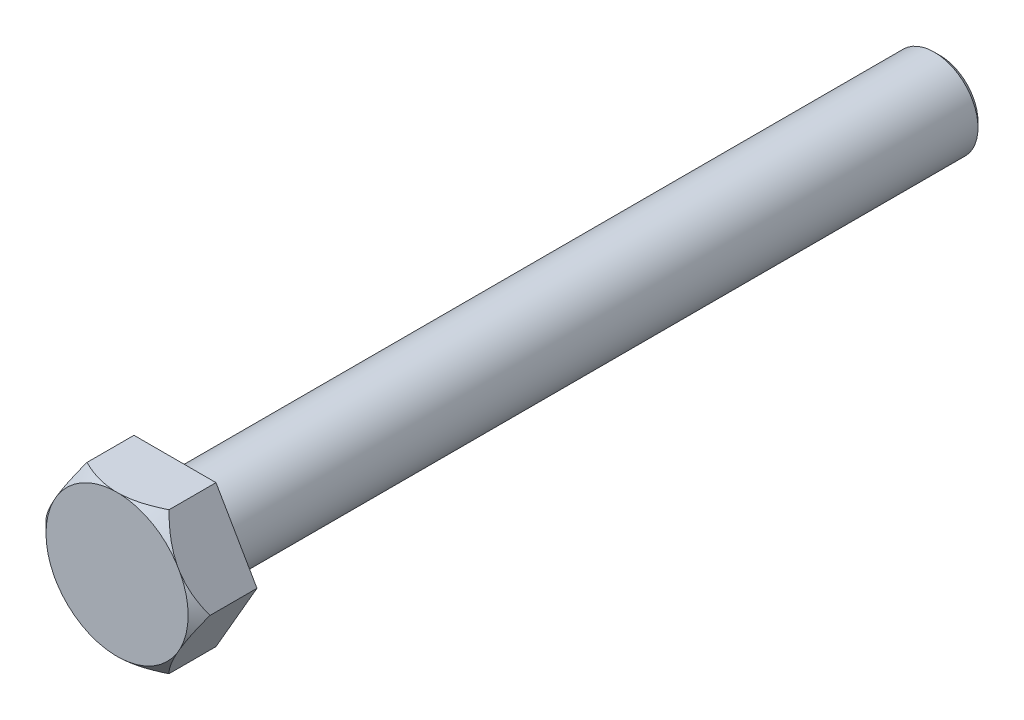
ISO-10303-21;
HEADER;
FILE_DESCRIPTION(('STEP AP214'),'2;1');
FILE_NAME('part.step','',(''),(''),'','','');
FILE_SCHEMA(('AUTOMOTIVE_DESIGN { 1 0 10303 214 1 1 1 1 }'));
ENDSEC;
DATA;
#1=APPLICATION_CONTEXT('core data for automotive mechanical design processes');
#2=APPLICATION_PROTOCOL_DEFINITION('international standard','automotive_design',2000,#1);
#3=PRODUCT_CONTEXT('',#1,'mechanical');
#4=PRODUCT('Part','Part','',(#3));
#5=PRODUCT_RELATED_PRODUCT_CATEGORY('part','',(#4));
#6=PRODUCT_DEFINITION_FORMATION('','',#4);
#7=PRODUCT_DEFINITION_CONTEXT('part definition',#1,'design');
#8=PRODUCT_DEFINITION('design','',#6,#7);
#9=PRODUCT_DEFINITION_SHAPE('','',#8);
#10=(LENGTH_UNIT() NAMED_UNIT(*) SI_UNIT(.MILLI.,.METRE.));
#11=(NAMED_UNIT(*) PLANE_ANGLE_UNIT() SI_UNIT($,.RADIAN.));
#12=(NAMED_UNIT(*) SI_UNIT($,.STERADIAN.) SOLID_ANGLE_UNIT());
#13=UNCERTAINTY_MEASURE_WITH_UNIT(LENGTH_MEASURE(1.E-05),#10,'distance_accuracy_value','');
#14=(GEOMETRIC_REPRESENTATION_CONTEXT(3) GLOBAL_UNCERTAINTY_ASSIGNED_CONTEXT((#13)) GLOBAL_UNIT_ASSIGNED_CONTEXT((#10,
#11,#12)) REPRESENTATION_CONTEXT('',''));
#15=CARTESIAN_POINT('',(0.,0.,0.));
#16=DIRECTION('',(0.,0.,1.));
#17=DIRECTION('',(1.,0.,0.));
#18=AXIS2_PLACEMENT_3D('',#15,#16,#17);
#19=CARTESIAN_POINT('',(0.,-4.,0.));
#20=DIRECTION('',(0.,0.,1.));
#21=DIRECTION('',(1.,0.,0.));
#22=AXIS2_PLACEMENT_3D('',#19,#20,#21);
#23=PLANE('',#22);
#24=CARTESIAN_POINT('',(0.,0.,0.));
#25=DIRECTION('',(0.,0.,1.));
#26=DIRECTION('',(1.,0.,0.));
#27=AXIS2_PLACEMENT_3D('',#24,#25,#26);
#28=CIRCLE('',#27,4.);
#29=CARTESIAN_POINT('',(4.,0.,0.));
#30=VERTEX_POINT('',#29);
#31=EDGE_CURVE('E11',#30,#30,#28,.T.);
#32=ORIENTED_EDGE('',*,*,#31,.T.);
#33=EDGE_LOOP('',(#32));
#34=FACE_BOUND('',#33,.T.);
#35=ADVANCED_FACE('F38',(#34),#23,.T.);
#36=CARTESIAN_POINT('',(0.,0.,0.));
#37=DIRECTION('',(0.,0.,1.));
#38=DIRECTION('',(1.,0.,0.));
#39=AXIS2_PLACEMENT_3D('',#36,#37,#38);
#40=CYLINDRICAL_SURFACE('',#39,4.);
#41=CARTESIAN_POINT('',(0.,0.,-69.5));
#42=DIRECTION('',(0.,0.,1.));
#43=DIRECTION('',(1.,0.,0.));
#44=AXIS2_PLACEMENT_3D('',#41,#42,#43);
#45=CIRCLE('',#44,4.);
#46=CARTESIAN_POINT('',(4.,0.,-69.5));
#47=VERTEX_POINT('',#46);
#48=EDGE_CURVE('E44',#47,#47,#45,.T.);
#49=ORIENTED_EDGE('',*,*,#48,.T.);
#50=EDGE_LOOP('',(#49));
#51=FACE_BOUND('',#50,.T.);
#52=ORIENTED_EDGE('',*,*,#31,.F.);
#53=EDGE_LOOP('',(#52));
#54=FACE_BOUND('',#53,.T.);
#55=ADVANCED_FACE('F64',(#51,#54),#40,.T.);
#56=CARTESIAN_POINT('',(0.,0.,-69.5));
#57=DIRECTION('',(0.,0.,1.));
#58=DIRECTION('',(1.,0.,0.));
#59=AXIS2_PLACEMENT_3D('',#56,#57,#58);
#60=CONICAL_SURFACE('',#59,4.,0.785398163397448);
#61=CARTESIAN_POINT('',(0.,0.,-70.));
#62=DIRECTION('',(0.,0.,1.));
#63=DIRECTION('',(1.,0.,0.));
#64=AXIS2_PLACEMENT_3D('',#61,#62,#63);
#65=CIRCLE('',#64,3.5);
#66=CARTESIAN_POINT('',(3.5,0.,-70.));
#67=VERTEX_POINT('',#66);
#68=EDGE_CURVE('E48',#67,#67,#65,.T.);
#69=ORIENTED_EDGE('',*,*,#68,.T.);
#70=EDGE_LOOP('',(#69));
#71=FACE_BOUND('',#70,.T.);
#72=ORIENTED_EDGE('',*,*,#48,.F.);
#73=EDGE_LOOP('',(#72));
#74=FACE_BOUND('',#73,.T.);
#75=ADVANCED_FACE('F55',(#71,#74),#60,.T.);
#76=CARTESIAN_POINT('',(0.,-3.5,-70.));
#77=DIRECTION('',(0.,0.,-1.));
#78=DIRECTION('',(-1.,0.,0.));
#79=AXIS2_PLACEMENT_3D('',#76,#77,#78);
#80=PLANE('',#79);
#81=ORIENTED_EDGE('',*,*,#68,.F.);
#82=EDGE_LOOP('',(#81));
#83=FACE_BOUND('',#82,.T.);
#84=ADVANCED_FACE('F58',(#83),#80,.T.);
#85=CLOSED_SHELL('',(#35,#55,#75,#84));
#86=MANIFOLD_SOLID_BREP('B2',#85);
#87=CARTESIAN_POINT('',(3.75277674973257,-6.5,5.3));
#88=DIRECTION('',(-0.866025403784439,0.5,0.));
#89=DIRECTION('',(-0.5,-0.866025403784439,0.));
#90=AXIS2_PLACEMENT_3D('',#87,#88,#89);
#91=PLANE('',#90);
#92=DIRECTION('',(0.,0.,-1.));
#93=VECTOR('',#92,1.);
#94=CARTESIAN_POINT('',(7.50555349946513,0.,5.3));
#95=LINE('',#94,#93);
#96=CARTESIAN_POINT('',(7.50555349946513,0.,4.3));
#97=VERTEX_POINT('',#96);
#98=CARTESIAN_POINT('',(7.50555349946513,0.,0.));
#99=VERTEX_POINT('',#98);
#100=EDGE_CURVE('E240',#97,#99,#95,.T.);
#101=ORIENTED_EDGE('',*,*,#100,.F.);
#102=CARTESIAN_POINT('',(10.1286443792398,4.54332667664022,0.704596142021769));
#103=CARTESIAN_POINT('',(10.039761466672,4.38937695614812,0.848684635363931));
#104=CARTESIAN_POINT('',(9.95052655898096,4.23481756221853,0.991912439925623));
#105=CARTESIAN_POINT('',(9.77123095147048,3.92426846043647,1.27631743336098));
#106=CARTESIAN_POINT('',(9.68117017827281,3.76827862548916,1.41749443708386));
#107=CARTESIAN_POINT('',(9.49990390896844,3.45431623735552,1.69777201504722));
#108=CARTESIAN_POINT('',(9.40869621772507,3.29633988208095,1.83686692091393));
#109=CARTESIAN_POINT('',(9.2252068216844,2.97852692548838,2.11218789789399));
#110=CARTESIAN_POINT('',(9.13292514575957,2.81869037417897,2.24841404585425));
#111=CARTESIAN_POINT('',(8.94456358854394,2.49243858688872,2.52115169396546));
#112=CARTESIAN_POINT('',(8.84844908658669,2.32596338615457,2.65756778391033));
#113=CARTESIAN_POINT('',(8.65470525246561,1.99038922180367,2.92602381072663));
#114=CARTESIAN_POINT('',(8.5570759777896,1.82129035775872,3.0580639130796));
#115=CARTESIAN_POINT('',(8.36013893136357,1.48018538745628,3.31668899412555));
#116=CARTESIAN_POINT('',(8.26083264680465,1.30818185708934,3.44327848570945));
#117=CARTESIAN_POINT('',(8.0601982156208,0.960672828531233,3.68985078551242));
#118=CARTESIAN_POINT('',(7.95887032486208,0.78516777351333,3.80983442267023));
#119=CARTESIAN_POINT('',(7.75111491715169,0.425324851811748,4.04472132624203));
#120=CARTESIAN_POINT('',(7.64462356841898,0.24087642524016,4.15940026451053));
#121=CARTESIAN_POINT('',(7.42883796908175,-0.132875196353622,4.37785828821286));
#122=CARTESIAN_POINT('',(7.31954332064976,-0.3221790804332,4.48163581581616));
#123=CARTESIAN_POINT('',(7.09850568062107,-0.705027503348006,4.67487713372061));
#124=CARTESIAN_POINT('',(6.98677906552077,-0.898543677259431,4.7644150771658));
#125=CARTESIAN_POINT('',(6.76025349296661,-1.29089747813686,4.92639894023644));
#126=CARTESIAN_POINT('',(6.64545547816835,-1.48973347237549,4.99885003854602));
#127=CARTESIAN_POINT('',(6.43587432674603,-1.85273867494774,5.11072478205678));
#128=CARTESIAN_POINT('',(6.34158660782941,-2.01604979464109,5.15384004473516));
#129=CARTESIAN_POINT('',(6.15157362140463,-2.34516194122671,5.22476075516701));
#130=CARTESIAN_POINT('',(6.0558485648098,-2.51096260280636,5.25256842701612));
#131=CARTESIAN_POINT('',(5.8637126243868,-2.84375181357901,5.29144611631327));
#132=CARTESIAN_POINT('',(5.76730326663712,-3.01073771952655,5.30254587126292));
#133=CARTESIAN_POINT('',(5.5743709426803,-3.34490630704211,5.30749252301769));
#134=CARTESIAN_POINT('',(5.47784797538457,-3.51208899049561,5.30133925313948));
#135=CARTESIAN_POINT('',(5.28569658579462,-3.84490496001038,5.27215863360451));
#136=CARTESIAN_POINT('',(5.19006652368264,-4.01054108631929,5.24917378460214));
#137=CARTESIAN_POINT('',(5.00008490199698,-4.33959890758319,5.18756324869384));
#138=CARTESIAN_POINT('',(4.90573344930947,-4.50302041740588,5.14893626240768));
#139=CARTESIAN_POINT('',(4.71846263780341,-4.82738297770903,5.05763503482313));
#140=CARTESIAN_POINT('',(4.6255484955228,-4.98831499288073,5.00491850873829));
#141=CARTESIAN_POINT('',(4.44167070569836,-5.30680066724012,4.88744691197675));
#142=CARTESIAN_POINT('',(4.35070696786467,-5.46435448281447,4.82269239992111));
#143=CARTESIAN_POINT('',(4.13900239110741,-5.83103756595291,4.65838995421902));
#144=CARTESIAN_POINT('',(4.01908237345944,-6.03874512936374,4.55462806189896));
#145=CARTESIAN_POINT('',(3.78262258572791,-6.4483054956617,4.33258564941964));
#146=CARTESIAN_POINT('',(3.66608473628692,-6.65015497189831,4.21429707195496));
#147=CARTESIAN_POINT('',(3.43582542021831,-7.0489758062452,3.96621331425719));
#148=CARTESIAN_POINT('',(3.3221102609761,-7.2459362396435,3.83639489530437));
#149=CARTESIAN_POINT('',(3.09735084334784,-7.63523097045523,3.56796602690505));
#150=CARTESIAN_POINT('',(2.98630610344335,-7.82756610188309,3.4293571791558));
#151=CARTESIAN_POINT('',(2.76596059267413,-8.20921572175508,3.14452754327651));
#152=CARTESIAN_POINT('',(2.65667036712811,-8.39851194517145,2.99827427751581));
#153=CARTESIAN_POINT('',(2.44001623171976,-8.77376791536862,2.70017211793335));
#154=CARTESIAN_POINT('',(2.33265239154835,-8.95972754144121,2.54832302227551));
#155=CARTESIAN_POINT('',(2.11967159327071,-9.32862110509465,2.24027391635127));
#156=CARTESIAN_POINT('',(2.01405293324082,-9.51155799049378,2.08407859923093));
#157=CARTESIAN_POINT('',(1.80420589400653,-9.87502372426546,1.76801397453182));
#158=CARTESIAN_POINT('',(1.69997748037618,-10.0555526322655,1.60814475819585));
#159=CARTESIAN_POINT('',(1.51776278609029,-10.3711577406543,1.32438976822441));
#160=CARTESIAN_POINT('',(1.43952456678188,-10.5066703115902,1.20114938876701));
#161=CARTESIAN_POINT('',(1.28399947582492,-10.7760476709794,0.953684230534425));
#162=CARTESIAN_POINT('',(1.20670993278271,-10.9099170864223,0.829466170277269));
#163=CARTESIAN_POINT('',(1.12968586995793,-11.0433266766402,0.704596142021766));
#164=B_SPLINE_CURVE_WITH_KNOTS('',3,(#102,#103,#104,#105,#106,#107,#108,#109,#110,#111,#112,
#113,#114,#115,#116,#117,#118,#119,#120,#121,#122,#123,#124,#125,#126,#127,#128,#129,#130,#131,
#132,#133,#134,#135,#136,#137,#138,#139,#140,#141,#142,#143,#144,#145,#146,#147,#148,#149,#150,
#151,#152,#153,#154,#155,#156,#157,#158,#159,#160,#161,#162,#163),.UNSPECIFIED.,.F.,.F.,(4,2,2,
2,2,2,2,2,2,2,2,2,2,2,2,2,2,2,2,2,2,2,2,2,2,2,2,2,2,2,4),(0.,0.686488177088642,1.3730379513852,
2.06120340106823,2.749350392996,3.4564439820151,4.16351080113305,4.8699804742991,
5.57636129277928,6.30179544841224,7.02733312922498,7.74895922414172,8.47036632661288,
9.05013970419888,9.62982882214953,10.2084849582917,10.7871466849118,11.3643522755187,
11.941605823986,12.52061163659,13.0995905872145,13.8829026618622,14.6666511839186,
15.4520168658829,16.2372398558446,17.0261239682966,17.8150365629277,18.6031280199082,
19.3911999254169,19.9887336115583,20.5836377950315),.UNSPECIFIED.);
#165=CARTESIAN_POINT('',(5.76353991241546,-3.01725604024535,5.3));
#166=VERTEX_POINT('',#165);
#167=EDGE_CURVE('E218',#97,#166,#164,.T.);
#168=ORIENTED_EDGE('',*,*,#167,.T.);
#169=DIRECTION('',(0.5,0.866025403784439,0.));
#170=VECTOR('',#169,1.);
#171=CARTESIAN_POINT('',(3.75277674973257,-6.5,5.3));
#172=LINE('',#171,#170);
#173=CARTESIAN_POINT('',(5.49479033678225,-3.48274395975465,5.3));
#174=VERTEX_POINT('',#173);
#175=EDGE_CURVE('E232',#174,#166,#172,.T.);
#176=ORIENTED_EDGE('',*,*,#175,.F.);
#177=CARTESIAN_POINT('',(3.75277674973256,-6.5,4.3));
#178=VERTEX_POINT('',#177);
#179=EDGE_CURVE('E305',#174,#178,#164,.T.);
#180=ORIENTED_EDGE('',*,*,#179,.T.);
#181=DIRECTION('',(0.,0.,-1.));
#182=VECTOR('',#181,1.);
#183=CARTESIAN_POINT('',(3.75277674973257,-6.5,5.3));
#184=LINE('',#183,#182);
#185=CARTESIAN_POINT('',(3.75277674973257,-6.5,0.));
#186=VERTEX_POINT('',#185);
#187=EDGE_CURVE('E213',#178,#186,#184,.T.);
#188=ORIENTED_EDGE('',*,*,#187,.T.);
#189=DIRECTION('',(0.5,0.866025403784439,0.));
#190=VECTOR('',#189,1.);
#191=CARTESIAN_POINT('',(3.75277674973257,-6.5,0.));
#192=LINE('',#191,#190);
#193=EDGE_CURVE('E214',#186,#99,#192,.T.);
#194=ORIENTED_EDGE('',*,*,#193,.T.);
#195=EDGE_LOOP('',(#101,#168,#176,#180,#188,#194));
#196=FACE_BOUND('',#195,.T.);
#197=ADVANCED_FACE('F93',(#196),#91,.F.);
#198=CARTESIAN_POINT('',(7.50555349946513,0.,5.3));
#199=DIRECTION('',(-0.866025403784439,-0.5,0.));
#200=DIRECTION('',(0.5,-0.866025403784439,0.));
#201=AXIS2_PLACEMENT_3D('',#198,#199,#200);
#202=PLANE('',#201);
#203=DIRECTION('',(0.,0.,-1.));
#204=VECTOR('',#203,1.);
#205=CARTESIAN_POINT('',(3.75277674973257,6.5,5.3));
#206=LINE('',#205,#204);
#207=CARTESIAN_POINT('',(3.75277674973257,6.5,4.3));
#208=VERTEX_POINT('',#207);
#209=CARTESIAN_POINT('',(3.75277674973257,6.5,0.));
#210=VERTEX_POINT('',#209);
#211=EDGE_CURVE('E239',#208,#210,#206,.T.);
#212=ORIENTED_EDGE('',*,*,#211,.F.);
#213=CARTESIAN_POINT('',(1.12968586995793,11.0433266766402,0.704596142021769));
#214=CARTESIAN_POINT('',(1.21856878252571,10.8893769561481,0.848684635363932));
#215=CARTESIAN_POINT('',(1.30780369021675,10.7348175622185,0.991912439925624));
#216=CARTESIAN_POINT('',(1.48709929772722,10.4242684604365,1.27631743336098));
#217=CARTESIAN_POINT('',(1.57716007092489,10.2682786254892,1.41749443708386));
#218=CARTESIAN_POINT('',(1.75842634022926,9.95431623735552,1.69777201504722));
#219=CARTESIAN_POINT('',(1.84963403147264,9.79633988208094,1.83686692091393));
#220=CARTESIAN_POINT('',(2.0331234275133,9.47852692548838,2.11218789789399));
#221=CARTESIAN_POINT('',(2.12540510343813,9.31869037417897,2.24841404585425));
#222=CARTESIAN_POINT('',(2.31376666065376,8.99243858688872,2.52115169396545));
#223=CARTESIAN_POINT('',(2.40988116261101,8.82596338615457,2.65756778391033));
#224=CARTESIAN_POINT('',(2.60362499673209,8.49038922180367,2.92602381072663));
#225=CARTESIAN_POINT('',(2.7012542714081,8.32129035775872,3.05806391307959));
#226=CARTESIAN_POINT('',(2.89819131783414,7.98018538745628,3.31668899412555));
#227=CARTESIAN_POINT('',(2.99749760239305,7.80818185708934,3.44327848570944));
#228=CARTESIAN_POINT('',(3.1981320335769,7.46067282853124,3.68985078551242));
#229=CARTESIAN_POINT('',(3.29945992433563,7.28516777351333,3.80983442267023));
#230=CARTESIAN_POINT('',(3.50721533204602,6.92532485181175,4.04472132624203));
#231=CARTESIAN_POINT('',(3.61370668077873,6.74087642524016,4.15940026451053));
#232=CARTESIAN_POINT('',(3.82949228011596,6.36712480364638,4.37785828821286));
#233=CARTESIAN_POINT('',(3.93878692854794,6.1778209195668,4.48163581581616));
#234=CARTESIAN_POINT('',(4.15982456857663,5.794972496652,4.67487713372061));
#235=CARTESIAN_POINT('',(4.27155118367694,5.60145632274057,4.7644150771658));
#236=CARTESIAN_POINT('',(4.49807675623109,5.20910252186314,4.92639894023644));
#237=CARTESIAN_POINT('',(4.61287477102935,5.01026652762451,4.99885003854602));
#238=CARTESIAN_POINT('',(4.82245592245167,4.64726132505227,5.11072478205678));
#239=CARTESIAN_POINT('',(4.91674364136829,4.48395020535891,5.15384004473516));
#240=CARTESIAN_POINT('',(5.10675662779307,4.15483805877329,5.22476075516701));
#241=CARTESIAN_POINT('',(5.20248168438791,3.98903739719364,5.25256842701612));
#242=CARTESIAN_POINT('',(5.3946176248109,3.65624818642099,5.29144611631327));
#243=CARTESIAN_POINT('',(5.49102698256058,3.48926228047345,5.30254587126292));
#244=CARTESIAN_POINT('',(5.6839593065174,3.15509369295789,5.30749252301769));
#245=CARTESIAN_POINT('',(5.78048227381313,2.98791100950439,5.30133925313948));
#246=CARTESIAN_POINT('',(5.97263366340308,2.65509503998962,5.27215863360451));
#247=CARTESIAN_POINT('',(6.06826372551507,2.48945891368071,5.24917378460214));
#248=CARTESIAN_POINT('',(6.25824534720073,2.16040109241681,5.18756324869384));
#249=CARTESIAN_POINT('',(6.35259679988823,1.99697958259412,5.14893626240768));
#250=CARTESIAN_POINT('',(6.5398676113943,1.67261702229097,5.05763503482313));
#251=CARTESIAN_POINT('',(6.6327817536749,1.51168500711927,5.00491850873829));
#252=CARTESIAN_POINT('',(6.81665954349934,1.19319933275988,4.88744691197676));
#253=CARTESIAN_POINT('',(6.90762328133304,1.03564551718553,4.82269239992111));
#254=CARTESIAN_POINT('',(7.1193278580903,0.668962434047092,4.65838995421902));
#255=CARTESIAN_POINT('',(7.23924787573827,0.461254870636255,4.55462806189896));
#256=CARTESIAN_POINT('',(7.4757076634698,0.0516945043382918,4.33258564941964));
#257=CARTESIAN_POINT('',(7.59224551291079,-0.150154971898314,4.21429707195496));
#258=CARTESIAN_POINT('',(7.82250482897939,-0.548975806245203,3.96621331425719));
#259=CARTESIAN_POINT('',(7.93621998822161,-0.7459362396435,3.83639489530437));
#260=CARTESIAN_POINT('',(8.16097940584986,-1.13523097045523,3.56796602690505));
#261=CARTESIAN_POINT('',(8.27202414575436,-1.32756610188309,3.4293571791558));
#262=CARTESIAN_POINT('',(8.49236965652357,-1.70921572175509,3.14452754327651));
#263=CARTESIAN_POINT('',(8.6016598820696,-1.89851194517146,2.99827427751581));
#264=CARTESIAN_POINT('',(8.81831401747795,-2.27376791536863,2.70017211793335));
#265=CARTESIAN_POINT('',(8.92567785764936,-2.45972754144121,2.5483230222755));
#266=CARTESIAN_POINT('',(9.138658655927,-2.82862110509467,2.24027391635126));
#267=CARTESIAN_POINT('',(9.24427731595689,-3.01155799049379,2.08407859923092));
#268=CARTESIAN_POINT('',(9.45412435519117,-3.37502372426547,1.76801397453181));
#269=CARTESIAN_POINT('',(9.55835276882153,-3.55555263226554,1.60814475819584));
#270=CARTESIAN_POINT('',(9.74056746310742,-3.87115774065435,1.3243897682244));
#271=CARTESIAN_POINT('',(9.81880568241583,-4.00667031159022,1.20114938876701));
#272=CARTESIAN_POINT('',(9.97433077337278,-4.27604767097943,0.953684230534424));
#273=CARTESIAN_POINT('',(10.051620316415,-4.40991708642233,0.829466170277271));
#274=CARTESIAN_POINT('',(10.1286443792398,-4.54332667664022,0.704596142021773));
#275=B_SPLINE_CURVE_WITH_KNOTS('',3,(#213,#214,#215,#216,#217,#218,#219,#220,#221,#222,#223,
#224,#225,#226,#227,#228,#229,#230,#231,#232,#233,#234,#235,#236,#237,#238,#239,#240,#241,#242,
#243,#244,#245,#246,#247,#248,#249,#250,#251,#252,#253,#254,#255,#256,#257,#258,#259,#260,#261,
#262,#263,#264,#265,#266,#267,#268,#269,#270,#271,#272,#273,#274),.UNSPECIFIED.,.F.,.F.,(4,2,2,
2,2,2,2,2,2,2,2,2,2,2,2,2,2,2,2,2,2,2,2,2,2,2,2,2,2,2,4),(0.,0.686488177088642,1.37303795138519,
2.06120340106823,2.749350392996,3.4564439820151,4.16351080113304,4.86998047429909,
5.57636129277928,6.30179544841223,7.02733312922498,7.74895922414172,8.47036632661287,
9.05013970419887,9.62982882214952,10.2084849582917,10.7871466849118,11.3643522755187,
11.941605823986,12.52061163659,13.0995905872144,13.8829026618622,14.6666511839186,
15.4520168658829,16.2372398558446,17.0261239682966,17.8150365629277,18.6031280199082,
19.391199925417,19.9887336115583,20.5836377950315),.UNSPECIFIED.);
#276=CARTESIAN_POINT('',(5.49479033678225,3.48274395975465,5.3));
#277=VERTEX_POINT('',#276);
#278=EDGE_CURVE('E268',#208,#277,#275,.T.);
#279=ORIENTED_EDGE('',*,*,#278,.T.);
#280=DIRECTION('',(-0.5,0.866025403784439,0.));
#281=VECTOR('',#280,1.);
#282=CARTESIAN_POINT('',(7.50555349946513,0.,5.3));
#283=LINE('',#282,#281);
#284=CARTESIAN_POINT('',(5.76353991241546,3.01725604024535,5.3));
#285=VERTEX_POINT('',#284);
#286=EDGE_CURVE('E207',#285,#277,#283,.T.);
#287=ORIENTED_EDGE('',*,*,#286,.F.);
#288=EDGE_CURVE('E273',#285,#97,#275,.T.);
#289=ORIENTED_EDGE('',*,*,#288,.T.);
#290=ORIENTED_EDGE('',*,*,#100,.T.);
#291=DIRECTION('',(-0.5,0.866025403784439,0.));
#292=VECTOR('',#291,1.);
#293=CARTESIAN_POINT('',(7.50555349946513,0.,0.));
#294=LINE('',#293,#292);
#295=EDGE_CURVE('E217',#99,#210,#294,.T.);
#296=ORIENTED_EDGE('',*,*,#295,.T.);
#297=EDGE_LOOP('',(#212,#279,#287,#289,#290,#296));
#298=FACE_BOUND('',#297,.T.);
#299=ADVANCED_FACE('F278',(#298),#202,.F.);
#300=CARTESIAN_POINT('',(3.75277674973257,6.5,5.3));
#301=DIRECTION('',(0.,-1.,0.));
#302=DIRECTION('',(1.,0.,0.));
#303=AXIS2_PLACEMENT_3D('',#300,#301,#302);
#304=PLANE('',#303);
#305=DIRECTION('',(0.,0.,-1.));
#306=VECTOR('',#305,1.);
#307=CARTESIAN_POINT('',(-3.75277674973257,6.5,5.3));
#308=LINE('',#307,#306);
#309=CARTESIAN_POINT('',(-3.75277674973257,6.5,4.3));
#310=VERTEX_POINT('',#309);
#311=CARTESIAN_POINT('',(-3.75277674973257,6.5,0.));
#312=VERTEX_POINT('',#311);
#313=EDGE_CURVE('E237',#310,#312,#308,.T.);
#314=ORIENTED_EDGE('',*,*,#313,.F.);
#315=CARTESIAN_POINT('',(-8.29610342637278,6.5,1.26632525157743));
#316=CARTESIAN_POINT('',(-8.11036530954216,6.5,1.41250581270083));
#317=CARTESIAN_POINT('',(-7.92373684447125,6.5,1.55756954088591));
#318=CARTESIAN_POINT('',(-7.54835509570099,6.5,1.84498409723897));
#319=CARTESIAN_POINT('',(-7.35960146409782,6.5,1.98733447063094));
#320=CARTESIAN_POINT('',(-6.97873252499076,6.5,2.2695011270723));
#321=CARTESIAN_POINT('',(-6.7866050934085,6.5,2.40930108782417));
#322=CARTESIAN_POINT('',(-6.39953728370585,6.5,2.68493925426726));
#323=CARTESIAN_POINT('',(-6.20459704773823,6.5,2.82077765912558));
#324=CARTESIAN_POINT('',(-5.80175036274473,6.5,3.09421885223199));
#325=CARTESIAN_POINT('',(-5.59367836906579,6.5,3.231578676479));
#326=CARTESIAN_POINT('',(-5.17329124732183,6.5,3.49972871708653));
#327=CARTESIAN_POINT('',(-4.96097565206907,6.5,3.63051820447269));
#328=CARTESIAN_POINT('',(-4.53185755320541,6.5,3.88357409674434));
#329=CARTESIAN_POINT('',(-4.31506466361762,6.5,4.00585671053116));
#330=CARTESIAN_POINT('',(-3.87593140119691,6.5,4.23995118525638));
#331=CARTESIAN_POINT('',(-3.65359273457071,6.5,4.35176621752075));
#332=CARTESIAN_POINT('',(-3.22593082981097,6.5,4.55126761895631));
#333=CARTESIAN_POINT('',(-3.02121813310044,6.5,4.64025315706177));
#334=CARTESIAN_POINT('',(-2.60646306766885,6.5,4.80502186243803));
#335=CARTESIAN_POINT('',(-2.39642019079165,6.5,4.88080376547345));
#336=CARTESIAN_POINT('',(-1.97356357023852,6.5,5.01546630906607));
#337=CARTESIAN_POINT('',(-1.76080909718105,6.5,5.07453054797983));
#338=CARTESIAN_POINT('',(-1.33093571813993,6.5,5.17398366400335));
#339=CARTESIAN_POINT('',(-1.11381737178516,6.5,5.21437492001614));
#340=CARTESIAN_POINT('',(-0.672554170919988,6.5,5.27457108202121));
#341=CARTESIAN_POINT('',(-0.448353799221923,6.5,5.29397782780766));
#342=CARTESIAN_POINT('',(0.000845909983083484,6.5,5.30942901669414));
#343=CARTESIAN_POINT('',(0.225845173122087,6.5,5.30547558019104));
#344=CARTESIAN_POINT('',(0.67488777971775,6.5,5.27446419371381));
#345=CARTESIAN_POINT('',(0.898926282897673,6.5,5.24733749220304));
#346=CARTESIAN_POINT('',(1.34336613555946,6.5,5.17180698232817));
#347=CARTESIAN_POINT('',(1.56376649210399,6.5,5.12339746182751));
#348=CARTESIAN_POINT('',(2.06628953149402,6.5,4.99055568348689));
#349=CARTESIAN_POINT('',(2.34668289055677,6.5,4.89963518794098));
#350=CARTESIAN_POINT('',(2.89824997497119,6.5,4.69329359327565));
#351=CARTESIAN_POINT('',(3.16941809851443,6.5,4.57785790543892));
#352=CARTESIAN_POINT('',(3.70495151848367,6.5,4.32757146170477));
#353=CARTESIAN_POINT('',(3.96925216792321,6.5,4.19258424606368));
#354=CARTESIAN_POINT('',(4.49001736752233,6.5,3.90855044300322));
#355=CARTESIAN_POINT('',(4.74648371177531,6.5,3.75950710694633));
#356=CARTESIAN_POINT('',(5.2907154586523,6.5,3.42770091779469));
#357=CARTESIAN_POINT('',(5.57743102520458,6.5,3.24322742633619));
#358=CARTESIAN_POINT('',(6.14392762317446,6.5,2.86387292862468));
#359=CARTESIAN_POINT('',(6.42370706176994,6.5,2.66898956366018));
#360=CARTESIAN_POINT('',(6.97140928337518,6.5,2.27586119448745));
#361=CARTESIAN_POINT('',(7.23945723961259,6.5,2.07778986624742));
#362=CARTESIAN_POINT('',(7.63813759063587,6.5,1.77641508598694));
#363=CARTESIAN_POINT('',(7.77042024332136,6.5,1.67528153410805));
#364=CARTESIAN_POINT('',(8.0339850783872,6.5,1.47172940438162));
#365=CARTESIAN_POINT('',(8.16526730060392,6.5,1.36931087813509));
#366=CARTESIAN_POINT('',(8.29610342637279,6.5,1.26632525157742));
#367=B_SPLINE_CURVE_WITH_KNOTS('',3,(#315,#316,#317,#318,#319,#320,#321,#322,#323,#324,#325,
#326,#327,#328,#329,#330,#331,#332,#333,#334,#335,#336,#337,#338,#339,#340,#341,#342,#343,#344,
#345,#346,#347,#348,#349,#350,#351,#352,#353,#354,#355,#356,#357,#358,#359,#360,#361,#362,#363,
#364,#365,#366),.UNSPECIFIED.,.F.,.F.,(4,2,2,2,2,2,2,2,2,2,2,2,2,2,2,2,2,2,2,2,2,2,2,2,2,4),(0.,
0.709097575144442,1.41831297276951,2.13109111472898,2.84383335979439,3.59170118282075,
4.3396517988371,5.0861358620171,5.83239302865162,6.5016733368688,7.17101769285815,
7.83269743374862,8.49429285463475,9.16823229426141,9.84211056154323,10.5179950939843,
11.1940611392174,12.0768086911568,12.9600830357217,13.8498492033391,14.7394100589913,
15.7619006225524,16.7846238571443,17.7843881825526,18.2839221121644,18.7834360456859),.UNSPECIFIED.);
#368=CARTESIAN_POINT('',(-0.26874957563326,6.5,5.3));
#369=VERTEX_POINT('',#368);
#370=EDGE_CURVE('E255',#310,#369,#367,.T.);
#371=ORIENTED_EDGE('',*,*,#370,.T.);
#372=DIRECTION('',(-1.,0.,0.));
#373=VECTOR('',#372,1.);
#374=CARTESIAN_POINT('',(3.75277674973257,6.5,5.3));
#375=LINE('',#374,#373);
#376=CARTESIAN_POINT('',(0.268749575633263,6.5,5.3));
#377=VERTEX_POINT('',#376);
#378=EDGE_CURVE('E203',#377,#369,#375,.T.);
#379=ORIENTED_EDGE('',*,*,#378,.F.);
#380=EDGE_CURVE('E261',#377,#208,#367,.T.);
#381=ORIENTED_EDGE('',*,*,#380,.T.);
#382=ORIENTED_EDGE('',*,*,#211,.T.);
#383=DIRECTION('',(-1.,0.,0.));
#384=VECTOR('',#383,1.);
#385=CARTESIAN_POINT('',(3.75277674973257,6.5,0.));
#386=LINE('',#385,#384);
#387=EDGE_CURVE('E221',#210,#312,#386,.T.);
#388=ORIENTED_EDGE('',*,*,#387,.T.);
#389=EDGE_LOOP('',(#314,#371,#379,#381,#382,#388));
#390=FACE_BOUND('',#389,.T.);
#391=ADVANCED_FACE('F259',(#390),#304,.F.);
#392=CARTESIAN_POINT('',(-3.75277674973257,6.5,5.3));
#393=DIRECTION('',(0.866025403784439,-0.5,0.));
#394=DIRECTION('',(0.5,0.866025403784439,0.));
#395=AXIS2_PLACEMENT_3D('',#392,#393,#394);
#396=PLANE('',#395);
#397=DIRECTION('',(0.,0.,-1.));
#398=VECTOR('',#397,1.);
#399=CARTESIAN_POINT('',(-7.50555349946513,0.,5.3));
#400=LINE('',#399,#398);
#401=CARTESIAN_POINT('',(-7.50555349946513,0.,4.3));
#402=VERTEX_POINT('',#401);
#403=CARTESIAN_POINT('',(-7.50555349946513,0.,0.));
#404=VERTEX_POINT('',#403);
#405=EDGE_CURVE('E195',#402,#404,#400,.T.);
#406=ORIENTED_EDGE('',*,*,#405,.F.);
#407=CARTESIAN_POINT('',(-10.1286443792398,-4.54332667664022,0.704596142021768));
#408=CARTESIAN_POINT('',(-10.039761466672,-4.38937695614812,0.84868463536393));
#409=CARTESIAN_POINT('',(-9.95052655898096,-4.23481756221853,0.991912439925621));
#410=CARTESIAN_POINT('',(-9.77123095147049,-3.92426846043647,1.27631743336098));
#411=CARTESIAN_POINT('',(-9.68117017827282,-3.76827862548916,1.41749443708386));
#412=CARTESIAN_POINT('',(-9.49990390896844,-3.45431623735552,1.69777201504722));
#413=CARTESIAN_POINT('',(-9.40869621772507,-3.29633988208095,1.83686692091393));
#414=CARTESIAN_POINT('',(-9.2252068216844,-2.97852692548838,2.11218789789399));
#415=CARTESIAN_POINT('',(-9.13292514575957,-2.81869037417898,2.24841404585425));
#416=CARTESIAN_POINT('',(-8.94456358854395,-2.49243858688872,2.52115169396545));
#417=CARTESIAN_POINT('',(-8.84844908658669,-2.32596338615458,2.65756778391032));
#418=CARTESIAN_POINT('',(-8.65470525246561,-1.99038922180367,2.92602381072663));
#419=CARTESIAN_POINT('',(-8.55707597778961,-1.82129035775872,3.05806391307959));
#420=CARTESIAN_POINT('',(-8.36013893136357,-1.48018538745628,3.31668899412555));
#421=CARTESIAN_POINT('',(-8.26083264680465,-1.30818185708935,3.44327848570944));
#422=CARTESIAN_POINT('',(-8.0601982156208,-0.96067282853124,3.68985078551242));
#423=CARTESIAN_POINT('',(-7.95887032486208,-0.785167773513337,3.80983442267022));
#424=CARTESIAN_POINT('',(-7.75111491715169,-0.425324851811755,4.04472132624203));
#425=CARTESIAN_POINT('',(-7.64462356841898,-0.240876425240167,4.15940026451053));
#426=CARTESIAN_POINT('',(-7.42883796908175,0.132875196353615,4.37785828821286));
#427=CARTESIAN_POINT('',(-7.31954332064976,0.322179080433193,4.48163581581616));
#428=CARTESIAN_POINT('',(-7.09850568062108,0.705027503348,4.67487713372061));
#429=CARTESIAN_POINT('',(-6.98677906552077,0.898543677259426,4.7644150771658));
#430=CARTESIAN_POINT('',(-6.76025349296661,1.29089747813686,4.92639894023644));
#431=CARTESIAN_POINT('',(-6.64545547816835,1.48973347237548,4.99885003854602));
#432=CARTESIAN_POINT('',(-6.43587432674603,1.85273867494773,5.11072478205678));
#433=CARTESIAN_POINT('',(-6.34158660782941,2.01604979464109,5.15384004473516));
#434=CARTESIAN_POINT('',(-6.15157362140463,2.3451619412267,5.22476075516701));
#435=CARTESIAN_POINT('',(-6.0558485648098,2.51096260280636,5.25256842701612));
#436=CARTESIAN_POINT('',(-5.86371262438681,2.84375181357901,5.29144611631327));
#437=CARTESIAN_POINT('',(-5.76730326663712,3.01073771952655,5.30254587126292));
#438=CARTESIAN_POINT('',(-5.5743709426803,3.3449063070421,5.30749252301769));
#439=CARTESIAN_POINT('',(-5.47784797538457,3.51208899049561,5.30133925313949));
#440=CARTESIAN_POINT('',(-5.28569658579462,3.84490496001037,5.27215863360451));
#441=CARTESIAN_POINT('',(-5.19006652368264,4.01054108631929,5.24917378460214));
#442=CARTESIAN_POINT('',(-5.00008490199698,4.33959890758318,5.18756324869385));
#443=CARTESIAN_POINT('',(-4.90573344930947,4.50302041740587,5.14893626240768));
#444=CARTESIAN_POINT('',(-4.71846263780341,4.82738297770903,5.05763503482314));
#445=CARTESIAN_POINT('',(-4.6255484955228,4.98831499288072,5.00491850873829));
#446=CARTESIAN_POINT('',(-4.44167070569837,5.30680066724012,4.88744691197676));
#447=CARTESIAN_POINT('',(-4.35070696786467,5.46435448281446,4.82269239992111));
#448=CARTESIAN_POINT('',(-4.13900239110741,5.8310375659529,4.65838995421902));
#449=CARTESIAN_POINT('',(-4.01908237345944,6.03874512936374,4.55462806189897));
#450=CARTESIAN_POINT('',(-3.78262258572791,6.4483054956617,4.33258564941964));
#451=CARTESIAN_POINT('',(-3.66608473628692,6.6501549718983,4.21429707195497));
#452=CARTESIAN_POINT('',(-3.43582542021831,7.04897580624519,3.9662133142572));
#453=CARTESIAN_POINT('',(-3.3221102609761,7.24593623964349,3.83639489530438));
#454=CARTESIAN_POINT('',(-3.09735084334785,7.63523097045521,3.56796602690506));
#455=CARTESIAN_POINT('',(-2.98630610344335,7.82756610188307,3.42935717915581));
#456=CARTESIAN_POINT('',(-2.76596059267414,8.20921572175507,3.14452754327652));
#457=CARTESIAN_POINT('',(-2.65667036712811,8.39851194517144,2.99827427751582));
#458=CARTESIAN_POINT('',(-2.44001623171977,8.77376791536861,2.70017211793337));
#459=CARTESIAN_POINT('',(-2.33265239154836,8.95972754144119,2.54832302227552));
#460=CARTESIAN_POINT('',(-2.11967159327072,9.32862110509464,2.24027391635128));
#461=CARTESIAN_POINT('',(-2.01405293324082,9.51155799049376,2.08407859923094));
#462=CARTESIAN_POINT('',(-1.80420589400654,9.87502372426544,1.76801397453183));
#463=CARTESIAN_POINT('',(-1.69997748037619,10.0555526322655,1.60814475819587));
#464=CARTESIAN_POINT('',(-1.51776278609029,10.3711577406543,1.32438976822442));
#465=CARTESIAN_POINT('',(-1.43952456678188,10.5066703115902,1.20114938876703));
#466=CARTESIAN_POINT('',(-1.28399947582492,10.7760476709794,0.953684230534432));
#467=CARTESIAN_POINT('',(-1.20670993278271,10.9099170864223,0.829466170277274));
#468=CARTESIAN_POINT('',(-1.12968586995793,11.0433266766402,0.704596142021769));
#469=B_SPLINE_CURVE_WITH_KNOTS('',3,(#407,#408,#409,#410,#411,#412,#413,#414,#415,#416,#417,
#418,#419,#420,#421,#422,#423,#424,#425,#426,#427,#428,#429,#430,#431,#432,#433,#434,#435,#436,
#437,#438,#439,#440,#441,#442,#443,#444,#445,#446,#447,#448,#449,#450,#451,#452,#453,#454,#455,
#456,#457,#458,#459,#460,#461,#462,#463,#464,#465,#466,#467,#468),.UNSPECIFIED.,.F.,.F.,(4,2,2,
2,2,2,2,2,2,2,2,2,2,2,2,2,2,2,2,2,2,2,2,2,2,2,2,2,2,2,4),(0.,0.686488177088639,1.37303795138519,
2.06120340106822,2.749350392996,3.45644398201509,4.16351080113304,4.86998047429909,
5.57636129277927,6.30179544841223,7.02733312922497,7.74895922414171,8.47036632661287,
9.05013970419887,9.62982882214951,10.2084849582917,10.7871466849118,11.3643522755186,
11.9416058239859,12.52061163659,13.0995905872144,13.8829026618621,14.6666511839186,
15.4520168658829,16.2372398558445,17.0261239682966,17.8150365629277,18.6031280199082,
19.3911999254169,19.9887336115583,20.5836377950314),.UNSPECIFIED.);
#470=CARTESIAN_POINT('',(-5.76353991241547,3.01725604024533,5.3));
#471=VERTEX_POINT('',#470);
#472=EDGE_CURVE('E182',#402,#471,#469,.T.);
#473=ORIENTED_EDGE('',*,*,#472,.T.);
#474=DIRECTION('',(-0.5,-0.866025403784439,0.));
#475=VECTOR('',#474,1.);
#476=CARTESIAN_POINT('',(-3.75277674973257,6.5,5.3));
#477=LINE('',#476,#475);
#478=CARTESIAN_POINT('',(-5.49479033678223,3.48274395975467,5.3));
#479=VERTEX_POINT('',#478);
#480=EDGE_CURVE('E193',#479,#471,#477,.T.);
#481=ORIENTED_EDGE('',*,*,#480,.F.);
#482=EDGE_CURVE('E196',#479,#310,#469,.T.);
#483=ORIENTED_EDGE('',*,*,#482,.T.);
#484=ORIENTED_EDGE('',*,*,#313,.T.);
#485=DIRECTION('',(-0.5,-0.866025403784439,0.));
#486=VECTOR('',#485,1.);
#487=CARTESIAN_POINT('',(-3.75277674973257,6.5,0.));
#488=LINE('',#487,#486);
#489=EDGE_CURVE('E224',#312,#404,#488,.T.);
#490=ORIENTED_EDGE('',*,*,#489,.T.);
#491=EDGE_LOOP('',(#406,#473,#481,#483,#484,#490));
#492=FACE_BOUND('',#491,.T.);
#493=ADVANCED_FACE('F191',(#492),#396,.F.);
#494=CARTESIAN_POINT('',(-7.50555349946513,0.,5.3));
#495=DIRECTION('',(0.866025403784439,0.5,0.));
#496=DIRECTION('',(-0.5,0.866025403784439,0.));
#497=AXIS2_PLACEMENT_3D('',#494,#495,#496);
#498=PLANE('',#497);
#499=DIRECTION('',(0.,0.,-1.));
#500=VECTOR('',#499,1.);
#501=CARTESIAN_POINT('',(-3.75277674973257,-6.5,5.3));
#502=LINE('',#501,#500);
#503=CARTESIAN_POINT('',(-3.75277674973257,-6.5,4.3));
#504=VERTEX_POINT('',#503);
#505=CARTESIAN_POINT('',(-3.75277674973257,-6.5,0.));
#506=VERTEX_POINT('',#505);
#507=EDGE_CURVE('E234',#504,#506,#502,.T.);
#508=ORIENTED_EDGE('',*,*,#507,.F.);
#509=CARTESIAN_POINT('',(-1.12968586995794,-11.0433266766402,0.70459614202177));
#510=CARTESIAN_POINT('',(-1.21856878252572,-10.8893769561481,0.848684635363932));
#511=CARTESIAN_POINT('',(-1.30780369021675,-10.7348175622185,0.991912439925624));
#512=CARTESIAN_POINT('',(-1.48709929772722,-10.4242684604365,1.27631743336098));
#513=CARTESIAN_POINT('',(-1.57716007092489,-10.2682786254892,1.41749443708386));
#514=CARTESIAN_POINT('',(-1.75842634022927,-9.95431623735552,1.69777201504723));
#515=CARTESIAN_POINT('',(-1.84963403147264,-9.79633988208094,1.83686692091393));
#516=CARTESIAN_POINT('',(-2.03312342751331,-9.47852692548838,2.11218789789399));
#517=CARTESIAN_POINT('',(-2.12540510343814,-9.31869037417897,2.24841404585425));
#518=CARTESIAN_POINT('',(-2.31376666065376,-8.99243858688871,2.52115169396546));
#519=CARTESIAN_POINT('',(-2.40988116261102,-8.82596338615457,2.65756778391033));
#520=CARTESIAN_POINT('',(-2.6036249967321,-8.49038922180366,2.92602381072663));
#521=CARTESIAN_POINT('',(-2.70125427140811,-8.32129035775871,3.0580639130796));
#522=CARTESIAN_POINT('',(-2.89819131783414,-7.98018538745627,3.31668899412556));
#523=CARTESIAN_POINT('',(-2.99749760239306,-7.80818185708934,3.44327848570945));
#524=CARTESIAN_POINT('',(-3.19813203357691,-7.46067282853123,3.68985078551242));
#525=CARTESIAN_POINT('',(-3.29945992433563,-7.28516777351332,3.80983442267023));
#526=CARTESIAN_POINT('',(-3.50721533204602,-6.92532485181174,4.04472132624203));
#527=CARTESIAN_POINT('',(-3.61370668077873,-6.74087642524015,4.15940026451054));
#528=CARTESIAN_POINT('',(-3.82949228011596,-6.36712480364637,4.37785828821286));
#529=CARTESIAN_POINT('',(-3.93878692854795,-6.17782091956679,4.48163581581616));
#530=CARTESIAN_POINT('',(-4.15982456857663,-5.79497249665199,4.67487713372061));
#531=CARTESIAN_POINT('',(-4.27155118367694,-5.60145632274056,4.7644150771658));
#532=CARTESIAN_POINT('',(-4.4980767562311,-5.20910252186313,4.92639894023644));
#533=CARTESIAN_POINT('',(-4.61287477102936,-5.0102665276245,4.99885003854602));
#534=CARTESIAN_POINT('',(-4.82245592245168,-4.64726132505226,5.11072478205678));
#535=CARTESIAN_POINT('',(-4.9167436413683,-4.4839502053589,5.15384004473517));
#536=CARTESIAN_POINT('',(-5.10675662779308,-4.15483805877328,5.22476075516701));
#537=CARTESIAN_POINT('',(-5.20248168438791,-3.98903739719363,5.25256842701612));
#538=CARTESIAN_POINT('',(-5.3946176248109,-3.65624818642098,5.29144611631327));
#539=CARTESIAN_POINT('',(-5.49102698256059,-3.48926228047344,5.30254587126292));
#540=CARTESIAN_POINT('',(-5.68395930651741,-3.15509369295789,5.30749252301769));
#541=CARTESIAN_POINT('',(-5.78048227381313,-2.98791100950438,5.30133925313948));
#542=CARTESIAN_POINT('',(-5.97263366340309,-2.65509503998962,5.27215863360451));
#543=CARTESIAN_POINT('',(-6.06826372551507,-2.4894589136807,5.24917378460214));
#544=CARTESIAN_POINT('',(-6.25824534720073,-2.16040109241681,5.18756324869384));
#545=CARTESIAN_POINT('',(-6.35259679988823,-1.99697958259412,5.14893626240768));
#546=CARTESIAN_POINT('',(-6.5398676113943,-1.67261702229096,5.05763503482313));
#547=CARTESIAN_POINT('',(-6.6327817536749,-1.51168500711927,5.00491850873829));
#548=CARTESIAN_POINT('',(-6.81665954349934,-1.19319933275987,4.88744691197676));
#549=CARTESIAN_POINT('',(-6.90762328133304,-1.03564551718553,4.82269239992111));
#550=CARTESIAN_POINT('',(-7.1193278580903,-0.668962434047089,4.65838995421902));
#551=CARTESIAN_POINT('',(-7.23924787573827,-0.461254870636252,4.55462806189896));
#552=CARTESIAN_POINT('',(-7.4757076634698,-0.0516945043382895,4.33258564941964));
#553=CARTESIAN_POINT('',(-7.59224551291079,0.150154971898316,4.21429707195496));
#554=CARTESIAN_POINT('',(-7.82250482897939,0.548975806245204,3.96621331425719));
#555=CARTESIAN_POINT('',(-7.9362199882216,0.745936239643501,3.83639489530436));
#556=CARTESIAN_POINT('',(-8.16097940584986,1.13523097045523,3.56796602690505));
#557=CARTESIAN_POINT('',(-8.27202414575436,1.32756610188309,3.4293571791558));
#558=CARTESIAN_POINT('',(-8.49236965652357,1.70921572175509,3.14452754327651));
#559=CARTESIAN_POINT('',(-8.6016598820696,1.89851194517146,2.99827427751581));
#560=CARTESIAN_POINT('',(-8.81831401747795,2.27376791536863,2.70017211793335));
#561=CARTESIAN_POINT('',(-8.92567785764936,2.45972754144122,2.5483230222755));
#562=CARTESIAN_POINT('',(-9.138658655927,2.82862110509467,2.24027391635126));
#563=CARTESIAN_POINT('',(-9.24427731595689,3.01155799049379,2.08407859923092));
#564=CARTESIAN_POINT('',(-9.45412435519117,3.37502372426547,1.76801397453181));
#565=CARTESIAN_POINT('',(-9.55835276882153,3.55555263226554,1.60814475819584));
#566=CARTESIAN_POINT('',(-9.74056746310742,3.87115774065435,1.3243897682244));
#567=CARTESIAN_POINT('',(-9.81880568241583,4.00667031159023,1.20114938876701));
#568=CARTESIAN_POINT('',(-9.97433077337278,4.27604767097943,0.953684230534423));
#569=CARTESIAN_POINT('',(-10.051620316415,4.40991708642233,0.82946617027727));
#570=CARTESIAN_POINT('',(-10.1286443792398,4.54332667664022,0.704596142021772));
#571=B_SPLINE_CURVE_WITH_KNOTS('',3,(#509,#510,#511,#512,#513,#514,#515,#516,#517,#518,#519,
#520,#521,#522,#523,#524,#525,#526,#527,#528,#529,#530,#531,#532,#533,#534,#535,#536,#537,#538,
#539,#540,#541,#542,#543,#544,#545,#546,#547,#548,#549,#550,#551,#552,#553,#554,#555,#556,#557,
#558,#559,#560,#561,#562,#563,#564,#565,#566,#567,#568,#569,#570),.UNSPECIFIED.,.F.,.F.,(4,2,2,
2,2,2,2,2,2,2,2,2,2,2,2,2,2,2,2,2,2,2,2,2,2,2,2,2,2,2,4),(0.,0.686488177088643,1.3730379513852,
2.06120340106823,2.74935039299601,3.4564439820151,4.16351080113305,4.8699804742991,
5.57636129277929,6.30179544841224,7.02733312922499,7.74895922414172,8.47036632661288,
9.05013970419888,9.62982882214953,10.2084849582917,10.7871466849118,11.3643522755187,
11.941605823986,12.52061163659,13.0995905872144,13.8829026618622,14.6666511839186,
15.4520168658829,16.2372398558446,17.0261239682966,17.8150365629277,18.6031280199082,
19.391199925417,19.9887336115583,20.5836377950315),.UNSPECIFIED.);
#572=CARTESIAN_POINT('',(-5.49479033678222,-3.48274395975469,5.3));
#573=VERTEX_POINT('',#572);
#574=EDGE_CURVE('E298',#504,#573,#571,.T.);
#575=ORIENTED_EDGE('',*,*,#574,.T.);
#576=DIRECTION('',(0.5,-0.866025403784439,0.));
#577=VECTOR('',#576,1.);
#578=CARTESIAN_POINT('',(-7.50555349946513,0.,5.3));
#579=LINE('',#578,#577);
#580=CARTESIAN_POINT('',(-5.76353991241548,-3.01725604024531,5.3));
#581=VERTEX_POINT('',#580);
#582=EDGE_CURVE('E202',#581,#573,#579,.T.);
#583=ORIENTED_EDGE('',*,*,#582,.F.);
#584=EDGE_CURVE('E117',#581,#402,#571,.T.);
#585=ORIENTED_EDGE('',*,*,#584,.T.);
#586=ORIENTED_EDGE('',*,*,#405,.T.);
#587=DIRECTION('',(0.5,-0.866025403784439,0.));
#588=VECTOR('',#587,1.);
#589=CARTESIAN_POINT('',(-7.50555349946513,0.,0.));
#590=LINE('',#589,#588);
#591=EDGE_CURVE('E226',#404,#506,#590,.T.);
#592=ORIENTED_EDGE('',*,*,#591,.T.);
#593=EDGE_LOOP('',(#508,#575,#583,#585,#586,#592));
#594=FACE_BOUND('',#593,.T.);
#595=ADVANCED_FACE('F315',(#594),#498,.F.);
#596=CARTESIAN_POINT('',(-3.75277674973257,-6.5,5.3));
#597=DIRECTION('',(0.,1.,0.));
#598=DIRECTION('',(-1.,0.,0.));
#599=AXIS2_PLACEMENT_3D('',#596,#597,#598);
#600=PLANE('',#599);
#601=ORIENTED_EDGE('',*,*,#187,.F.);
#602=CARTESIAN_POINT('',(8.29610342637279,-6.5,1.26632525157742));
#603=CARTESIAN_POINT('',(8.11036530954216,-6.5,1.41250581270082));
#604=CARTESIAN_POINT('',(7.92373684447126,-6.5,1.55756954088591));
#605=CARTESIAN_POINT('',(7.54835509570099,-6.5,1.84498409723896));
#606=CARTESIAN_POINT('',(7.35960146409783,-6.5,1.98733447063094));
#607=CARTESIAN_POINT('',(6.97873252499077,-6.5,2.2695011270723));
#608=CARTESIAN_POINT('',(6.7866050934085,-6.5,2.40930108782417));
#609=CARTESIAN_POINT('',(6.39953728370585,-6.5,2.68493925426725));
#610=CARTESIAN_POINT('',(6.20459704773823,-6.5,2.82077765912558));
#611=CARTESIAN_POINT('',(5.80175036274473,-6.5,3.09421885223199));
#612=CARTESIAN_POINT('',(5.5936783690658,-6.5,3.23157867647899));
#613=CARTESIAN_POINT('',(5.17329124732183,-6.5,3.49972871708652));
#614=CARTESIAN_POINT('',(4.96097565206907,-6.5,3.63051820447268));
#615=CARTESIAN_POINT('',(4.53185755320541,-6.5,3.88357409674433));
#616=CARTESIAN_POINT('',(4.31506466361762,-6.5,4.00585671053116));
#617=CARTESIAN_POINT('',(3.87593140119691,-6.5,4.23995118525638));
#618=CARTESIAN_POINT('',(3.65359273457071,-6.5,4.35176621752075));
#619=CARTESIAN_POINT('',(3.22593082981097,-6.5,4.55126761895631));
#620=CARTESIAN_POINT('',(3.02121813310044,-6.5,4.64025315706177));
#621=CARTESIAN_POINT('',(2.60646306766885,-6.5,4.80502186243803));
#622=CARTESIAN_POINT('',(2.39642019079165,-6.5,4.88080376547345));
#623=CARTESIAN_POINT('',(1.97356357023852,-6.5,5.01546630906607));
#624=CARTESIAN_POINT('',(1.76080909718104,-6.5,5.07453054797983));
#625=CARTESIAN_POINT('',(1.33093571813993,-6.5,5.17398366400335));
#626=CARTESIAN_POINT('',(1.11381737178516,-6.5,5.21437492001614));
#627=CARTESIAN_POINT('',(0.672554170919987,-6.5,5.27457108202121));
#628=CARTESIAN_POINT('',(0.448353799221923,-6.5,5.29397782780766));
#629=CARTESIAN_POINT('',(-0.000845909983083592,-6.5,5.30942901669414));
#630=CARTESIAN_POINT('',(-0.225845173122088,-6.5,5.30547558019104));
#631=CARTESIAN_POINT('',(-0.674887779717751,-6.5,5.27446419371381));
#632=CARTESIAN_POINT('',(-0.898926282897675,-6.5,5.24733749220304));
#633=CARTESIAN_POINT('',(-1.34336613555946,-6.5,5.17180698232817));
#634=CARTESIAN_POINT('',(-1.56376649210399,-6.5,5.12339746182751));
#635=CARTESIAN_POINT('',(-2.06628953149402,-6.5,4.99055568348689));
#636=CARTESIAN_POINT('',(-2.34668289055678,-6.5,4.89963518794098));
#637=CARTESIAN_POINT('',(-2.8982499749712,-6.5,4.69329359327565));
#638=CARTESIAN_POINT('',(-3.16941809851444,-6.5,4.57785790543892));
#639=CARTESIAN_POINT('',(-3.70495151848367,-6.5,4.32757146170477));
#640=CARTESIAN_POINT('',(-3.96925216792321,-6.5,4.19258424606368));
#641=CARTESIAN_POINT('',(-4.49001736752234,-6.5,3.90855044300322));
#642=CARTESIAN_POINT('',(-4.74648371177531,-6.5,3.75950710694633));
#643=CARTESIAN_POINT('',(-5.2907154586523,-6.5,3.42770091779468));
#644=CARTESIAN_POINT('',(-5.57743102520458,-6.5,3.24322742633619));
#645=CARTESIAN_POINT('',(-6.14392762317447,-6.5,2.86387292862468));
#646=CARTESIAN_POINT('',(-6.42370706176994,-6.5,2.66898956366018));
#647=CARTESIAN_POINT('',(-6.97140928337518,-6.5,2.27586119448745));
#648=CARTESIAN_POINT('',(-7.23945723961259,-6.5,2.07778986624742));
#649=CARTESIAN_POINT('',(-7.63813759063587,-6.5,1.77641508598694));
#650=CARTESIAN_POINT('',(-7.77042024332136,-6.5,1.67528153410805));
#651=CARTESIAN_POINT('',(-8.03398507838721,-6.5,1.47172940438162));
#652=CARTESIAN_POINT('',(-8.16526730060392,-6.5,1.36931087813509));
#653=CARTESIAN_POINT('',(-8.29610342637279,-6.5,1.26632525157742));
#654=B_SPLINE_CURVE_WITH_KNOTS('',3,(#602,#603,#604,#605,#606,#607,#608,#609,#610,#611,#612,
#613,#614,#615,#616,#617,#618,#619,#620,#621,#622,#623,#624,#625,#626,#627,#628,#629,#630,#631,
#632,#633,#634,#635,#636,#637,#638,#639,#640,#641,#642,#643,#644,#645,#646,#647,#648,#649,#650,
#651,#652,#653),.UNSPECIFIED.,.F.,.F.,(4,2,2,2,2,2,2,2,2,2,2,2,2,2,2,2,2,2,2,2,2,2,2,2,2,4),(0.,
0.709097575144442,1.41831297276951,2.13109111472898,2.8438333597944,3.59170118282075,
4.33965179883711,5.0861358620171,5.83239302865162,6.50167333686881,7.17101769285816,
7.83269743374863,8.49429285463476,9.16823229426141,9.84211056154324,10.5179950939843,
11.1940611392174,12.0768086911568,12.9600830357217,13.8498492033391,14.7394100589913,
15.7619006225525,16.7846238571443,17.7843881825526,18.2839221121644,18.7834360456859),.UNSPECIFIED.);
#655=CARTESIAN_POINT('',(0.268749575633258,-6.5,5.3));
#656=VERTEX_POINT('',#655);
#657=EDGE_CURVE('E352',#178,#656,#654,.T.);
#658=ORIENTED_EDGE('',*,*,#657,.T.);
#659=DIRECTION('',(1.,0.,0.));
#660=VECTOR('',#659,1.);
#661=CARTESIAN_POINT('',(-3.75277674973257,-6.5,5.3));
#662=LINE('',#661,#660);
#663=CARTESIAN_POINT('',(-0.268749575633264,-6.5,5.3));
#664=VERTEX_POINT('',#663);
#665=EDGE_CURVE('E205',#664,#656,#662,.T.);
#666=ORIENTED_EDGE('',*,*,#665,.F.);
#667=EDGE_CURVE('E109',#664,#504,#654,.T.);
#668=ORIENTED_EDGE('',*,*,#667,.T.);
#669=ORIENTED_EDGE('',*,*,#507,.T.);
#670=DIRECTION('',(1.,0.,0.));
#671=VECTOR('',#670,1.);
#672=CARTESIAN_POINT('',(-3.75277674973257,-6.5,0.));
#673=LINE('',#672,#671);
#674=EDGE_CURVE('E229',#506,#186,#673,.T.);
#675=ORIENTED_EDGE('',*,*,#674,.T.);
#676=EDGE_LOOP('',(#601,#658,#666,#668,#669,#675));
#677=FACE_BOUND('',#676,.T.);
#678=ADVANCED_FACE('F355',(#677),#600,.F.);
#679=CARTESIAN_POINT('',(7.50555349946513,0.,5.3));
#680=DIRECTION('',(0.,0.,1.));
#681=DIRECTION('',(1.,0.,0.));
#682=AXIS2_PLACEMENT_3D('',#679,#680,#681);
#683=PLANE('',#682);
#684=CARTESIAN_POINT('',(0.,0.,5.3));
#685=DIRECTION('',(0.,0.,1.));
#686=DIRECTION('',(1.,0.,0.));
#687=AXIS2_PLACEMENT_3D('',#684,#685,#686);
#688=CIRCLE('',#687,6.50555349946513);
#689=EDGE_CURVE('E36',#174,#656,#688,.F.);
#690=ORIENTED_EDGE('',*,*,#689,.F.);
#691=ORIENTED_EDGE('',*,*,#175,.T.);
#692=EDGE_CURVE('E97',#285,#166,#688,.F.);
#693=ORIENTED_EDGE('',*,*,#692,.F.);
#694=ORIENTED_EDGE('',*,*,#286,.T.);
#695=EDGE_CURVE('E245',#377,#277,#688,.F.);
#696=ORIENTED_EDGE('',*,*,#695,.F.);
#697=ORIENTED_EDGE('',*,*,#378,.T.);
#698=EDGE_CURVE('E187',#479,#369,#688,.F.);
#699=ORIENTED_EDGE('',*,*,#698,.F.);
#700=ORIENTED_EDGE('',*,*,#480,.T.);
#701=EDGE_CURVE('E179',#581,#471,#688,.F.);
#702=ORIENTED_EDGE('',*,*,#701,.F.);
#703=ORIENTED_EDGE('',*,*,#582,.T.);
#704=EDGE_CURVE('E102',#664,#573,#688,.F.);
#705=ORIENTED_EDGE('',*,*,#704,.F.);
#706=ORIENTED_EDGE('',*,*,#665,.T.);
#707=EDGE_LOOP('',(#690,#691,#693,#694,#696,#697,#699,#700,#702,#703,#705,#706));
#708=FACE_BOUND('',#707,.T.);
#709=ADVANCED_FACE('F200',(#708),#683,.T.);
#710=CARTESIAN_POINT('',(7.50555349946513,0.,0.));
#711=DIRECTION('',(0.,0.,1.));
#712=DIRECTION('',(1.,0.,0.));
#713=AXIS2_PLACEMENT_3D('',#710,#711,#712);
#714=PLANE('',#713);
#715=ORIENTED_EDGE('',*,*,#193,.F.);
#716=ORIENTED_EDGE('',*,*,#674,.F.);
#717=ORIENTED_EDGE('',*,*,#591,.F.);
#718=ORIENTED_EDGE('',*,*,#489,.F.);
#719=ORIENTED_EDGE('',*,*,#387,.F.);
#720=ORIENTED_EDGE('',*,*,#295,.F.);
#721=EDGE_LOOP('',(#715,#716,#717,#718,#719,#720));
#722=FACE_BOUND('',#721,.T.);
#723=ADVANCED_FACE('F285',(#722),#714,.F.);
#724=CARTESIAN_POINT('',(0.,0.,5.3));
#725=DIRECTION('',(0.,0.,-1.));
#726=DIRECTION('',(-1.,0.,0.));
#727=AXIS2_PLACEMENT_3D('',#724,#725,#726);
#728=CONICAL_SURFACE('',#727,6.50555349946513,0.785398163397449);
#729=ORIENTED_EDGE('',*,*,#288,.F.);
#730=ORIENTED_EDGE('',*,*,#692,.T.);
#731=ORIENTED_EDGE('',*,*,#167,.F.);
#732=EDGE_LOOP('',(#729,#730,#731));
#733=FACE_BOUND('',#732,.T.);
#734=ADVANCED_FACE('F280',(#733),#728,.T.);
#735=ORIENTED_EDGE('',*,*,#380,.F.);
#736=ORIENTED_EDGE('',*,*,#695,.T.);
#737=ORIENTED_EDGE('',*,*,#278,.F.);
#738=EDGE_LOOP('',(#735,#736,#737));
#739=FACE_BOUND('',#738,.T.);
#740=ADVANCED_FACE('F284',(#739),#728,.T.);
#741=ORIENTED_EDGE('',*,*,#482,.F.);
#742=ORIENTED_EDGE('',*,*,#698,.T.);
#743=ORIENTED_EDGE('',*,*,#370,.F.);
#744=EDGE_LOOP('',(#741,#742,#743));
#745=FACE_BOUND('',#744,.T.);
#746=ADVANCED_FACE('F254',(#745),#728,.T.);
#747=ORIENTED_EDGE('',*,*,#584,.F.);
#748=ORIENTED_EDGE('',*,*,#701,.T.);
#749=ORIENTED_EDGE('',*,*,#472,.F.);
#750=EDGE_LOOP('',(#747,#748,#749));
#751=FACE_BOUND('',#750,.T.);
#752=ADVANCED_FACE('F181',(#751),#728,.T.);
#753=ORIENTED_EDGE('',*,*,#667,.F.);
#754=ORIENTED_EDGE('',*,*,#704,.T.);
#755=ORIENTED_EDGE('',*,*,#574,.F.);
#756=EDGE_LOOP('',(#753,#754,#755));
#757=FACE_BOUND('',#756,.T.);
#758=ADVANCED_FACE('F286',(#757),#728,.T.);
#759=ORIENTED_EDGE('',*,*,#689,.T.);
#760=ORIENTED_EDGE('',*,*,#657,.F.);
#761=ORIENTED_EDGE('',*,*,#179,.F.);
#762=EDGE_LOOP('',(#759,#760,#761));
#763=FACE_BOUND('',#762,.T.);
#764=ADVANCED_FACE('F343',(#763),#728,.T.);
#765=CLOSED_SHELL('',(#197,#299,#391,#493,#595,#678,#709,#723,#734,#740,#746,#752,#758,#764));
#766=MANIFOLD_SOLID_BREP('B6',#765);
#767=ADVANCED_BREP_SHAPE_REPRESENTATION('',(#18,#86,#766),#14);
#768=SHAPE_DEFINITION_REPRESENTATION(#9,#767);
ENDSEC;
END-ISO-10303-21;
